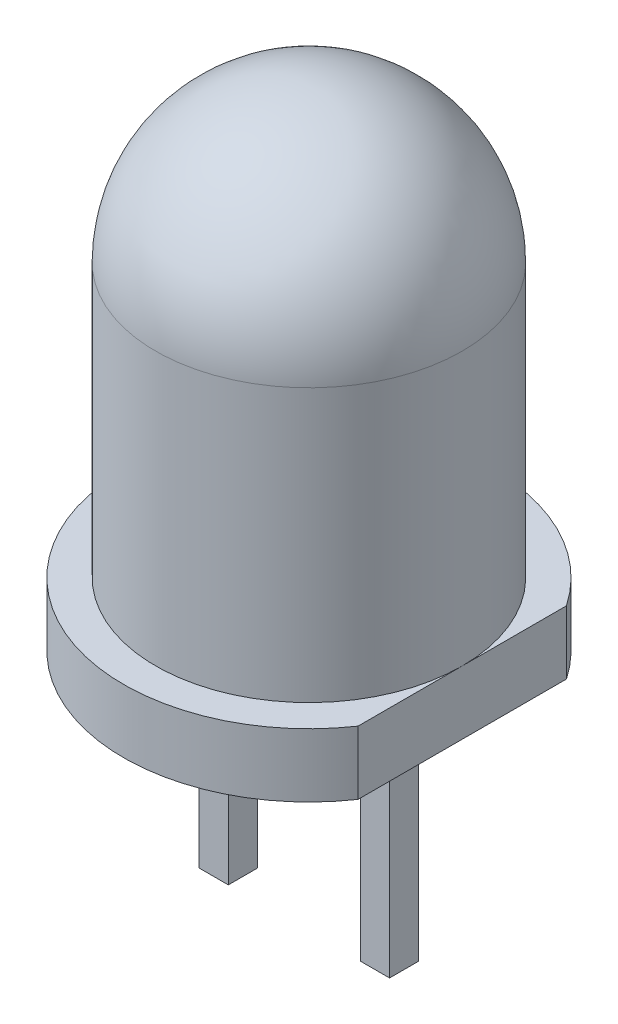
from build123d import *

# Parameters (mm, degrees)
SKETCH_2_W          = 0.46
SKETCH_2_H          = 0.46
EXTRUDE_1_DEPTH     = 3.6
CUT_EXTRUDE_START   = 2
CUT_EXTRUDE_2_DEPTH = 2
FILLET_1_R          = 0.8


with BuildPart() as part:
    # Sketch 1 → Revolve 1 (revolve)
    with BuildSketch(Plane.XY, mode=Mode.PRIVATE) as revolve_1_sk:
        with BuildLine():
            Line((0, 1), (2.92, 1))
            Line((2.92, 1), (2.92, 2))
            Line((2.92, 2), (2.415, 2))
            Line((2.415, 2), (2.415, 6.295))
            ThreePointArc((2.415, 6.295), (1.707662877, 8.002662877), (0, 8.71))
            Line((0, 8.71), (0, 1))
        make_face()
    revolve(revolve_1_sk.sketch.rotate(Axis((0, 8.71, 0), (0, -1, 0)), 180), axis=Axis((0, 8.71, 0), (0, -1, 0)))

    # Sketch 2 → Extrude 1 (add)
    with BuildSketch(Plane.XZ.offset(-1)):
        with Locations((-1.27, 0)):
            Rectangle(SKETCH_2_W, SKETCH_2_H)
        with Locations((1.27, 0)):
            Rectangle(SKETCH_2_W, SKETCH_2_H)
    extrude(amount=EXTRUDE_1_DEPTH)

    # Sketch 3 → Cut-Extrude 2 (cut)
    with BuildSketch(Plane(origin=(0, 0, 0), x_dir=(1, 0, 0), z_dir=(0, 1, 0)).offset(CUT_EXTRUDE_START)):
        with BuildLine():
            Line((2.415, 1.641394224), (2.415, -1.641394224))
            ThreePointArc((2.415, -1.641394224), (2.92, 0), (2.415, 1.641394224))
        make_face()
    extrude(amount=-CUT_EXTRUDE_2_DEPTH, mode=Mode.SUBTRACT)

    # Fillet 1
    fillet_1_edges = [part.edges().sort_by_distance(p)[0] for p in [
        (-1.5, 1, 0),
        (-1.27, 1, -0.23),
        (-1.04, 1, 0),
        (-1.27, 1, 0.23),
        (1.27, 1, 0.23),
        (1.04, 1, 0),
        (1.27, 1, -0.23),
        (1.5, 1, 0),
    ]]
    fillet(fillet_1_edges, radius=FILLET_1_R)


solid = part.part
